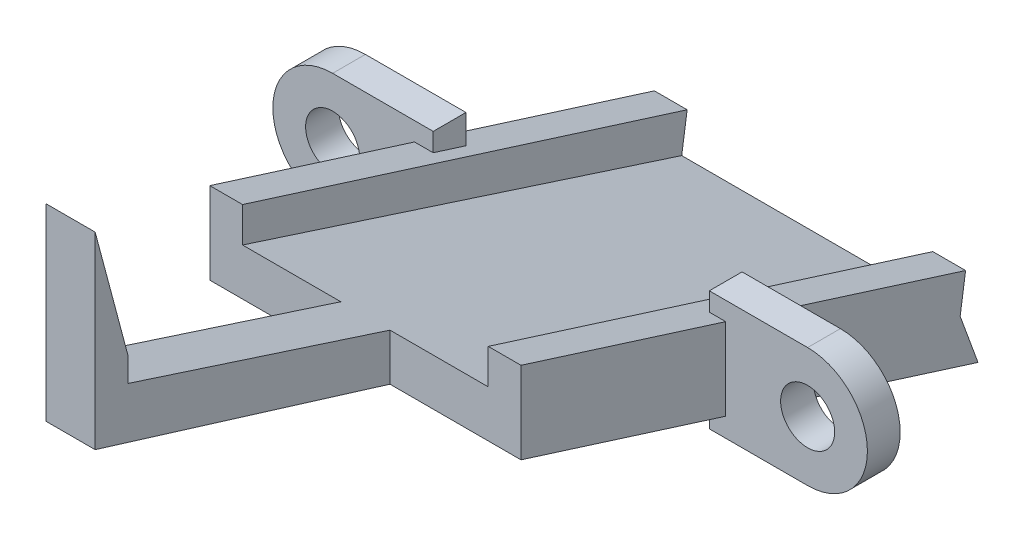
from build123d import *

# Parameters (mm, degrees)
SALIENTE_EXTRUIR1_DEPTH = 1.5
SALIENTE_EXTRUIR2_DEPTH = 9.5
SALIENTE_EXTRUIR3_START = 9.5
SALIENTE_EXTRUIR3_DEPTH = 2
SALIENTE_EXTRUIR4_START = -9.5
SALIENTE_EXTRUIR4_DEPTH = 2
CROQUIS6_R              = 1.65
SALIENTE_EXTRUIR5_DEPTH = 2


with BuildPart() as part:
    # Croquis2 → Saliente-Extruir1 (new, symmetric)
    with BuildSketch(Plane(origin=(0, 0, 0), x_dir=(0, 0, -1), z_dir=(1, 0, 0))):
        Polygon((0, 0), (0, 10.641059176), (0, 11.505697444), (0.221822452, 10.673231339), (2, 4), (2, 2.5), (44.813090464, -11.357823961), (45.901798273, -14.337919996), (32.5, -10), align=None)
    extrude(amount=SALIENTE_EXTRUIR1_DEPTH, both=True)

    # Croquis3 → Saliente-Extruir2 (add, symmetric)
    with BuildSketch(Plane(origin=(0, 0, 0), x_dir=(0, 0, -1), z_dir=(1, 0, 0))):
        Polygon((18, -2.678910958), (18, -5.538461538), (45.901798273, -14.337919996), (44.813090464, -11.357823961), align=None)
    extrude(amount=SALIENTE_EXTRUIR2_DEPTH, both=True)

    # Croquis5 → Saliente-Extruir3 (add)
    with BuildSketch(Plane(origin=(0, 0, 0), x_dir=(0, 0, -1), z_dir=(1, 0, 0)).offset(SALIENTE_EXTRUIR3_START)):
        Polygon((45.901798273, -14.337919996), (18, -5.538461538), (18, -0.538461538), (45.145219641, -9.09931594), (44.813090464, -11.357823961), align=None)
    extrude(amount=-SALIENTE_EXTRUIR3_DEPTH)

    # Croquis5_2 → Saliente-Extruir4 (add)
    with BuildSketch(Plane(origin=(0, 0, 0), x_dir=(0, 0, -1), z_dir=(1, 0, 0)).offset(SALIENTE_EXTRUIR4_START)):
        Polygon((18, -5.538461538), (45.901798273, -14.337919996), (44.813090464, -11.357823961), (18, -2.678910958), align=None)
        Polygon((18, -2.678910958), (44.813090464, -11.357823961), (45.145219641, -9.09931594), (18, -0.538461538), align=None)
    extrude(amount=SALIENTE_EXTRUIR4_DEPTH)

    # Croquis6 → Saliente-Extruir5 (add)
    # profile 1 of 2: a face of its own
    with BuildSketch(Plane.XY.offset(-32.5)):
        with BuildLine():
            Line((-14.5, -3.35), (-8.360143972, -3.35))
            Line((-8.360143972, -3.35), (-8.360143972, -10.65))
            Line((-8.360143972, -10.65), (-14.5, -10.65))
            ThreePointArc((-14.5, -10.65), (-18.15, -7), (-14.5, -3.35))
        make_face()
        with Locations((-14.5, -7)):
            Circle(CROQUIS6_R, mode=Mode.SUBTRACT)
    # profile 2 of 2: a face of its own
    with BuildSketch(Plane.XY.offset(-32.5)):
        with BuildLine():
            Line((8.498709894, -3.35), (8.498709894, -10.65))
            Line((8.498709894, -10.65), (14.5, -10.65))
            ThreePointArc((14.5, -10.65), (18.15, -7), (14.5, -3.35))
            Line((14.5, -3.35), (8.498709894, -3.35))
        make_face()
        with Locations(Location((14.5, -7, 0), (0, 0, 180))):
            Circle(CROQUIS6_R, mode=Mode.SUBTRACT)
    extrude(amount=SALIENTE_EXTRUIR5_DEPTH)


solid = part.part
